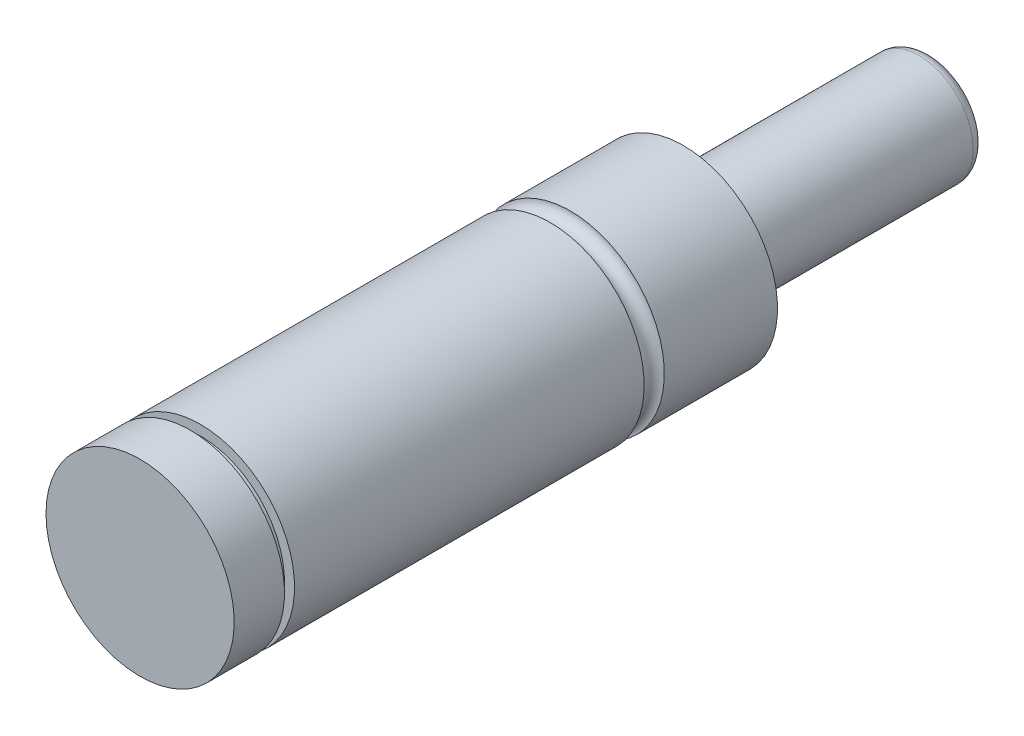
ISO-10303-21;
HEADER;
FILE_DESCRIPTION(('STEP AP214'),'2;1');
FILE_NAME('part.step','',(''),(''),'','','');
FILE_SCHEMA(('AUTOMOTIVE_DESIGN { 1 0 10303 214 1 1 1 1 }'));
ENDSEC;
DATA;
#1=APPLICATION_CONTEXT('core data for automotive mechanical design processes');
#2=APPLICATION_PROTOCOL_DEFINITION('international standard','automotive_design',2000,#1);
#3=PRODUCT_CONTEXT('',#1,'mechanical');
#4=PRODUCT('Part','Part','',(#3));
#5=PRODUCT_RELATED_PRODUCT_CATEGORY('part','',(#4));
#6=PRODUCT_DEFINITION_FORMATION('','',#4);
#7=PRODUCT_DEFINITION_CONTEXT('part definition',#1,'design');
#8=PRODUCT_DEFINITION('design','',#6,#7);
#9=PRODUCT_DEFINITION_SHAPE('','',#8);
#10=(LENGTH_UNIT() NAMED_UNIT(*) SI_UNIT(.MILLI.,.METRE.));
#11=(NAMED_UNIT(*) PLANE_ANGLE_UNIT() SI_UNIT($,.RADIAN.));
#12=(NAMED_UNIT(*) SI_UNIT($,.STERADIAN.) SOLID_ANGLE_UNIT());
#13=UNCERTAINTY_MEASURE_WITH_UNIT(LENGTH_MEASURE(1.E-05),#10,'distance_accuracy_value','');
#14=(GEOMETRIC_REPRESENTATION_CONTEXT(3) GLOBAL_UNCERTAINTY_ASSIGNED_CONTEXT((#13)) GLOBAL_UNIT_ASSIGNED_CONTEXT((#10,
#11,#12)) REPRESENTATION_CONTEXT('',''));
#15=CARTESIAN_POINT('',(0.,0.,0.));
#16=DIRECTION('',(0.,0.,1.));
#17=DIRECTION('',(1.,0.,0.));
#18=AXIS2_PLACEMENT_3D('',#15,#16,#17);
#19=CARTESIAN_POINT('',(0.,0.,-88.0737961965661));
#20=DIRECTION('',(0.,0.,-1.));
#21=DIRECTION('',(-1.,0.,0.));
#22=AXIS2_PLACEMENT_3D('',#19,#20,#21);
#23=CYLINDRICAL_SURFACE('',#22,5.461);
#24=CARTESIAN_POINT('',(0.,0.,-78.6638));
#25=DIRECTION('',(0.,0.,-1.));
#26=DIRECTION('',(-1.,0.,0.));
#27=AXIS2_PLACEMENT_3D('',#24,#25,#26);
#28=CIRCLE('',#27,5.46099999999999);
#29=CARTESIAN_POINT('',(-5.46099999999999,0.,-78.6638));
#30=VERTEX_POINT('',#29);
#31=EDGE_CURVE('E10',#30,#30,#28,.T.);
#32=ORIENTED_EDGE('',*,*,#31,.F.);
#33=EDGE_LOOP('',(#32));
#34=FACE_BOUND('',#33,.T.);
#35=CARTESIAN_POINT('',(0.,0.,-54.864));
#36=DIRECTION('',(0.,0.,-1.));
#37=DIRECTION('',(-1.,0.,0.));
#38=AXIS2_PLACEMENT_3D('',#35,#36,#37);
#39=CIRCLE('',#38,5.461);
#40=CARTESIAN_POINT('',(-5.461,0.,-54.864));
#41=VERTEX_POINT('',#40);
#42=EDGE_CURVE('E94',#41,#41,#39,.T.);
#43=ORIENTED_EDGE('',*,*,#42,.T.);
#44=EDGE_LOOP('',(#43));
#45=FACE_BOUND('',#44,.T.);
#46=ADVANCED_FACE('F45',(#34,#45),#23,.T.);
#47=CARTESIAN_POINT('',(0.,0.,-78.6638));
#48=DIRECTION('',(0.,0.,-1.));
#49=DIRECTION('',(-1.,0.,0.));
#50=AXIS2_PLACEMENT_3D('',#47,#48,#49);
#51=TOROIDAL_SURFACE('',#50,4.2672,1.19379999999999);
#52=CARTESIAN_POINT('',(0.,0.,-79.8576));
#53=DIRECTION('',(0.,0.,-1.));
#54=DIRECTION('',(-1.,0.,0.));
#55=AXIS2_PLACEMENT_3D('',#52,#53,#54);
#56=CIRCLE('',#55,4.2672);
#57=CARTESIAN_POINT('',(-4.2672,0.,-79.8576));
#58=VERTEX_POINT('',#57);
#59=EDGE_CURVE('E52',#58,#58,#56,.T.);
#60=ORIENTED_EDGE('',*,*,#59,.F.);
#61=EDGE_LOOP('',(#60));
#62=FACE_BOUND('',#61,.T.);
#63=ORIENTED_EDGE('',*,*,#31,.T.);
#64=EDGE_LOOP('',(#63));
#65=FACE_BOUND('',#64,.T.);
#66=ADVANCED_FACE('F156',(#62,#65),#51,.T.);
#67=CARTESIAN_POINT('',(-4.2672,0.,-79.8576));
#68=DIRECTION('',(0.,0.,1.));
#69=DIRECTION('',(1.,0.,0.));
#70=AXIS2_PLACEMENT_3D('',#67,#68,#69);
#71=PLANE('',#70);
#72=ORIENTED_EDGE('',*,*,#59,.T.);
#73=EDGE_LOOP('',(#72));
#74=FACE_BOUND('',#73,.T.);
#75=ADVANCED_FACE('F151',(#74),#71,.F.);
#76=CARTESIAN_POINT('',(0.,0.,0.));
#77=DIRECTION('',(0.,0.,-1.));
#78=DIRECTION('',(-1.,0.,0.));
#79=AXIS2_PLACEMENT_3D('',#76,#77,#78);
#80=PLANE('',#79);
#81=CARTESIAN_POINT('',(0.,0.,0.));
#82=DIRECTION('',(0.,0.,-1.));
#83=DIRECTION('',(-1.,0.,0.));
#84=AXIS2_PLACEMENT_3D('',#81,#82,#83);
#85=CIRCLE('',#84,9.4996);
#86=CARTESIAN_POINT('',(-9.49960000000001,0.,0.));
#87=VERTEX_POINT('',#86);
#88=EDGE_CURVE('E58',#87,#87,#85,.T.);
#89=ORIENTED_EDGE('',*,*,#88,.F.);
#90=EDGE_LOOP('',(#89));
#91=FACE_BOUND('',#90,.T.);
#92=ADVANCED_FACE('F146',(#91),#80,.F.);
#93=CARTESIAN_POINT('',(0.,0.,-88.0737961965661));
#94=DIRECTION('',(0.,0.,-1.));
#95=DIRECTION('',(-1.,0.,0.));
#96=AXIS2_PLACEMENT_3D('',#93,#94,#95);
#97=CYLINDRICAL_SURFACE('',#96,9.4996);
#98=CARTESIAN_POINT('',(0.,0.,-5.08));
#99=DIRECTION('',(0.,0.,-1.));
#100=DIRECTION('',(-1.,0.,0.));
#101=AXIS2_PLACEMENT_3D('',#98,#99,#100);
#102=CIRCLE('',#101,9.4996);
#103=CARTESIAN_POINT('',(-9.49960000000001,0.,-5.08));
#104=VERTEX_POINT('',#103);
#105=EDGE_CURVE('E64',#104,#104,#102,.T.);
#106=ORIENTED_EDGE('',*,*,#105,.F.);
#107=EDGE_LOOP('',(#106));
#108=FACE_BOUND('',#107,.T.);
#109=ORIENTED_EDGE('',*,*,#88,.T.);
#110=EDGE_LOOP('',(#109));
#111=FACE_BOUND('',#110,.T.);
#112=ADVANCED_FACE('F140',(#108,#111),#97,.T.);
#113=CARTESIAN_POINT('',(-9.49960000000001,0.,-5.08));
#114=DIRECTION('',(0.,0.,1.));
#115=DIRECTION('',(1.,0.,0.));
#116=AXIS2_PLACEMENT_3D('',#113,#114,#115);
#117=PLANE('',#116);
#118=CARTESIAN_POINT('',(0.,0.,-5.08));
#119=DIRECTION('',(0.,0.,-1.));
#120=DIRECTION('',(-1.,0.,0.));
#121=AXIS2_PLACEMENT_3D('',#118,#119,#120);
#122=CIRCLE('',#121,8.4836);
#123=CARTESIAN_POINT('',(-8.48360000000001,0.,-5.08));
#124=VERTEX_POINT('',#123);
#125=EDGE_CURVE('E70',#124,#124,#122,.T.);
#126=ORIENTED_EDGE('',*,*,#125,.F.);
#127=EDGE_LOOP('',(#126));
#128=FACE_BOUND('',#127,.T.);
#129=ORIENTED_EDGE('',*,*,#105,.T.);
#130=EDGE_LOOP('',(#129));
#131=FACE_BOUND('',#130,.T.);
#132=ADVANCED_FACE('F134',(#128,#131),#117,.F.);
#133=CARTESIAN_POINT('',(0.,0.,-88.0737961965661));
#134=DIRECTION('',(0.,0.,-1.));
#135=DIRECTION('',(-1.,0.,0.));
#136=AXIS2_PLACEMENT_3D('',#133,#134,#135);
#137=CYLINDRICAL_SURFACE('',#136,8.4836);
#138=CARTESIAN_POINT('',(0.,0.,-6.096));
#139=DIRECTION('',(0.,0.,-1.));
#140=DIRECTION('',(-1.,0.,0.));
#141=AXIS2_PLACEMENT_3D('',#138,#139,#140);
#142=CIRCLE('',#141,8.4836);
#143=CARTESIAN_POINT('',(-8.48360000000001,0.,-6.09600000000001));
#144=VERTEX_POINT('',#143);
#145=EDGE_CURVE('E74',#144,#144,#142,.T.);
#146=ORIENTED_EDGE('',*,*,#145,.F.);
#147=EDGE_LOOP('',(#146));
#148=FACE_BOUND('',#147,.T.);
#149=ORIENTED_EDGE('',*,*,#125,.T.);
#150=EDGE_LOOP('',(#149));
#151=FACE_BOUND('',#150,.T.);
#152=ADVANCED_FACE('F128',(#148,#151),#137,.T.);
#153=CARTESIAN_POINT('',(-8.48360000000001,0.,-6.096));
#154=DIRECTION('',(0.,0.,-1.));
#155=DIRECTION('',(-1.,0.,0.));
#156=AXIS2_PLACEMENT_3D('',#153,#154,#155);
#157=PLANE('',#156);
#158=CARTESIAN_POINT('',(0.,0.,-6.096));
#159=DIRECTION('',(0.,0.,-1.));
#160=DIRECTION('',(-1.,0.,0.));
#161=AXIS2_PLACEMENT_3D('',#158,#159,#160);
#162=CIRCLE('',#161,9.4996);
#163=CARTESIAN_POINT('',(-9.49960000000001,0.,-6.09600000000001));
#164=VERTEX_POINT('',#163);
#165=EDGE_CURVE('E78',#164,#164,#162,.T.);
#166=ORIENTED_EDGE('',*,*,#165,.F.);
#167=EDGE_LOOP('',(#166));
#168=FACE_BOUND('',#167,.T.);
#169=ORIENTED_EDGE('',*,*,#145,.T.);
#170=EDGE_LOOP('',(#169));
#171=FACE_BOUND('',#170,.T.);
#172=ADVANCED_FACE('F122',(#168,#171),#157,.F.);
#173=CARTESIAN_POINT('',(0.,0.,-88.0737961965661));
#174=DIRECTION('',(0.,0.,-1.));
#175=DIRECTION('',(-1.,0.,0.));
#176=AXIS2_PLACEMENT_3D('',#173,#174,#175);
#177=CYLINDRICAL_SURFACE('',#176,9.49960000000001);
#178=CARTESIAN_POINT('',(0.,0.,-41.402));
#179=DIRECTION('',(0.,0.,-1.));
#180=DIRECTION('',(-1.,0.,0.));
#181=AXIS2_PLACEMENT_3D('',#178,#179,#180);
#182=CIRCLE('',#181,9.49960000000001);
#183=CARTESIAN_POINT('',(-9.49960000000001,0.,-41.402));
#184=VERTEX_POINT('',#183);
#185=EDGE_CURVE('E82',#184,#184,#182,.T.);
#186=ORIENTED_EDGE('',*,*,#185,.F.);
#187=EDGE_LOOP('',(#186));
#188=FACE_BOUND('',#187,.T.);
#189=ORIENTED_EDGE('',*,*,#165,.T.);
#190=EDGE_LOOP('',(#189));
#191=FACE_BOUND('',#190,.T.);
#192=ADVANCED_FACE('F116',(#188,#191),#177,.T.);
#193=CARTESIAN_POINT('',(0.,0.,-42.418));
#194=DIRECTION('',(0.,0.,-1.));
#195=DIRECTION('',(-1.,0.,0.));
#196=AXIS2_PLACEMENT_3D('',#193,#194,#195);
#197=TOROIDAL_SURFACE('',#196,9.4996,1.016);
#198=CARTESIAN_POINT('',(0.,0.,-43.434));
#199=DIRECTION('',(0.,0.,-1.));
#200=DIRECTION('',(-1.,0.,0.));
#201=AXIS2_PLACEMENT_3D('',#198,#199,#200);
#202=CIRCLE('',#201,9.49960000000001);
#203=CARTESIAN_POINT('',(-9.49960000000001,0.,-43.434));
#204=VERTEX_POINT('',#203);
#205=EDGE_CURVE('E86',#204,#204,#202,.T.);
#206=ORIENTED_EDGE('',*,*,#205,.F.);
#207=EDGE_LOOP('',(#206));
#208=FACE_BOUND('',#207,.T.);
#209=ORIENTED_EDGE('',*,*,#185,.T.);
#210=EDGE_LOOP('',(#209));
#211=FACE_BOUND('',#210,.T.);
#212=ADVANCED_FACE('F110',(#208,#211),#197,.F.);
#213=CARTESIAN_POINT('',(0.,0.,-88.0737961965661));
#214=DIRECTION('',(0.,0.,-1.));
#215=DIRECTION('',(-1.,0.,0.));
#216=AXIS2_PLACEMENT_3D('',#213,#214,#215);
#217=CYLINDRICAL_SURFACE('',#216,9.49960000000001);
#218=CARTESIAN_POINT('',(0.,0.,-54.864));
#219=DIRECTION('',(0.,0.,-1.));
#220=DIRECTION('',(-1.,0.,0.));
#221=AXIS2_PLACEMENT_3D('',#218,#219,#220);
#222=CIRCLE('',#221,9.49960000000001);
#223=CARTESIAN_POINT('',(-9.49960000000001,0.,-54.864));
#224=VERTEX_POINT('',#223);
#225=EDGE_CURVE('E90',#224,#224,#222,.T.);
#226=ORIENTED_EDGE('',*,*,#225,.F.);
#227=EDGE_LOOP('',(#226));
#228=FACE_BOUND('',#227,.T.);
#229=ORIENTED_EDGE('',*,*,#205,.T.);
#230=EDGE_LOOP('',(#229));
#231=FACE_BOUND('',#230,.T.);
#232=ADVANCED_FACE('F104',(#228,#231),#217,.T.);
#233=CARTESIAN_POINT('',(-5.461,0.,-54.864));
#234=DIRECTION('',(0.,0.,1.));
#235=DIRECTION('',(1.,0.,0.));
#236=AXIS2_PLACEMENT_3D('',#233,#234,#235);
#237=PLANE('',#236);
#238=ORIENTED_EDGE('',*,*,#42,.F.);
#239=EDGE_LOOP('',(#238));
#240=FACE_BOUND('',#239,.T.);
#241=ORIENTED_EDGE('',*,*,#225,.T.);
#242=EDGE_LOOP('',(#241));
#243=FACE_BOUND('',#242,.T.);
#244=ADVANCED_FACE('F101',(#240,#243),#237,.F.);
#245=CLOSED_SHELL('',(#46,#66,#75,#92,#112,#132,#152,#172,#192,#212,#232,#244));
#246=MANIFOLD_SOLID_BREP('B2',#245);
#247=ADVANCED_BREP_SHAPE_REPRESENTATION('',(#18,#246),#14);
#248=SHAPE_DEFINITION_REPRESENTATION(#9,#247);
ENDSEC;
END-ISO-10303-21;
